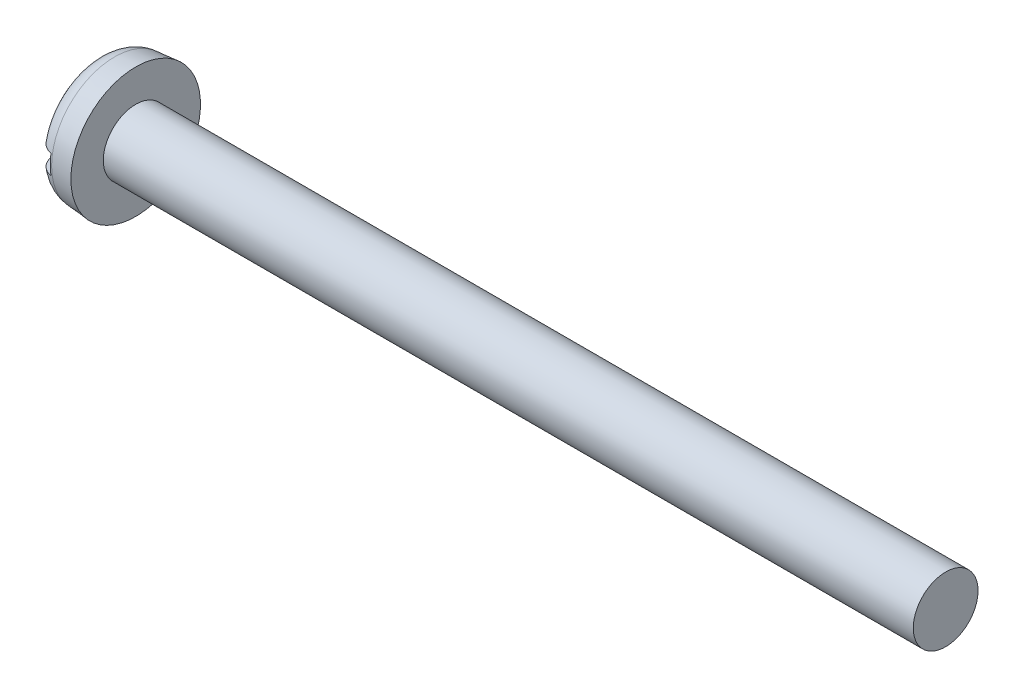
from build123d import *

# Parameters (mm, degrees)
FILLET2_R  = 1.2
SKETCH2_W  = 8
SKETCH2_H  = 1.2
SLOT_DEPTH = 1


with BuildPart() as part:
    # BodySke → Base-Revolve (revolve)
    with BuildSketch(Plane.XY, mode=Mode.PRIVATE) as base_revolve_sk:
        Polygon((2.4, 2), (2.4, 4), (0, 3.790027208), (0, 0), (52.4, 0), (52.4, 2), align=None)
    revolve(base_revolve_sk.sketch.rotate(Axis((-25.4, 0, 0), (1, 0, 0)), 90), axis=Axis((-25.4, 0, 0), (1, 0, 0)))

    # Fillet2
    fillet2_edges = [part.edges().sort_by_distance(p)[0] for p in [
        (0, 0, -3.790027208),
    ]]
    fillet(fillet2_edges, radius=FILLET2_R)

    # Sketch2 → Slot (cut)
    with BuildSketch(Plane(origin=(0, 0, 0), x_dir=(0, 0, -1), z_dir=(1, 0, 0))):
        Rectangle(SKETCH2_W, SKETCH2_H)
    extrude(amount=SLOT_DEPTH, mode=Mode.SUBTRACT)


solid = part.part
